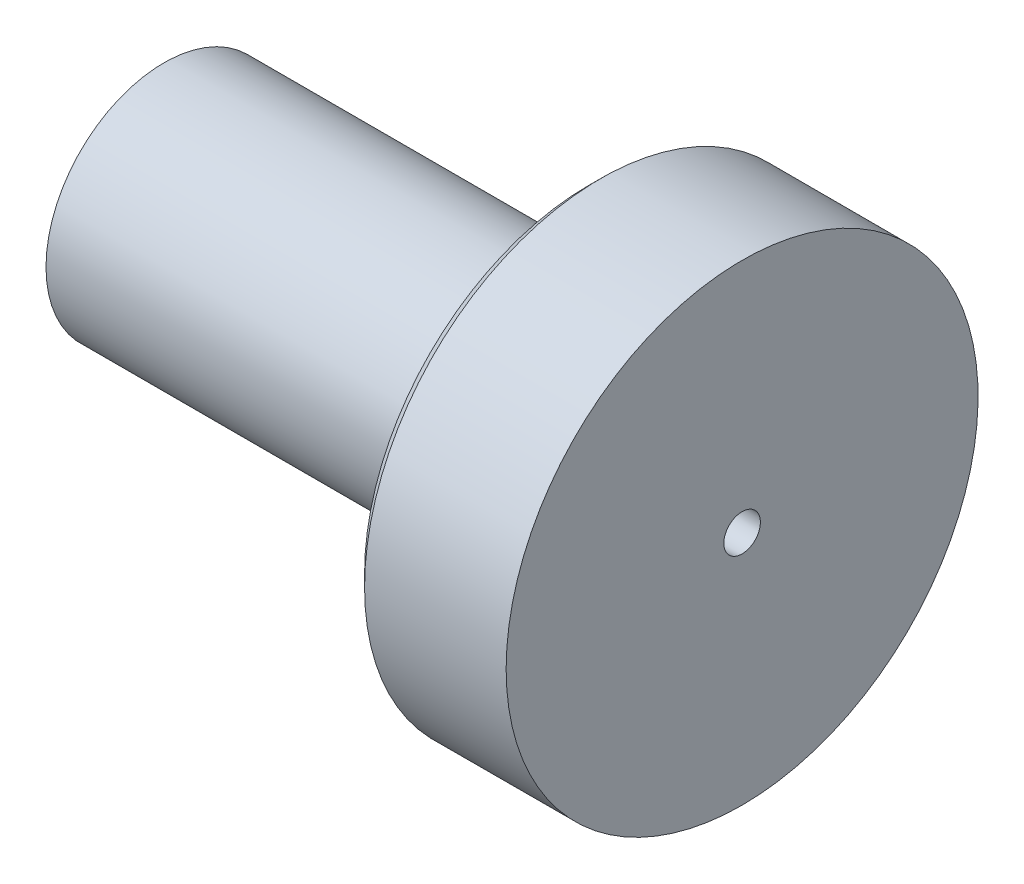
ISO-10303-21;
HEADER;
FILE_DESCRIPTION(('STEP AP214'),'2;1');
FILE_NAME('part.step','',(''),(''),'','','');
FILE_SCHEMA(('AUTOMOTIVE_DESIGN { 1 0 10303 214 1 1 1 1 }'));
ENDSEC;
DATA;
#1=APPLICATION_CONTEXT('core data for automotive mechanical design processes');
#2=APPLICATION_PROTOCOL_DEFINITION('international standard','automotive_design',2000,#1);
#3=PRODUCT_CONTEXT('',#1,'mechanical');
#4=PRODUCT('Part','Part','',(#3));
#5=PRODUCT_RELATED_PRODUCT_CATEGORY('part','',(#4));
#6=PRODUCT_DEFINITION_FORMATION('','',#4);
#7=PRODUCT_DEFINITION_CONTEXT('part definition',#1,'design');
#8=PRODUCT_DEFINITION('design','',#6,#7);
#9=PRODUCT_DEFINITION_SHAPE('','',#8);
#10=(LENGTH_UNIT() NAMED_UNIT(*) SI_UNIT(.MILLI.,.METRE.));
#11=(NAMED_UNIT(*) PLANE_ANGLE_UNIT() SI_UNIT($,.RADIAN.));
#12=(NAMED_UNIT(*) SI_UNIT($,.STERADIAN.) SOLID_ANGLE_UNIT());
#13=UNCERTAINTY_MEASURE_WITH_UNIT(LENGTH_MEASURE(1.E-05),#10,'distance_accuracy_value','');
#14=(GEOMETRIC_REPRESENTATION_CONTEXT(3) GLOBAL_UNCERTAINTY_ASSIGNED_CONTEXT((#13)) GLOBAL_UNIT_ASSIGNED_CONTEXT((#10,
#11,#12)) REPRESENTATION_CONTEXT('',''));
#15=CARTESIAN_POINT('',(0.,0.,0.));
#16=DIRECTION('',(0.,0.,1.));
#17=DIRECTION('',(1.,0.,0.));
#18=AXIS2_PLACEMENT_3D('',#15,#16,#17);
#19=CARTESIAN_POINT('',(0.,0.,0.));
#20=DIRECTION('',(-1.,0.,0.));
#21=DIRECTION('',(0.,0.,1.));
#22=AXIS2_PLACEMENT_3D('',#19,#20,#21);
#23=CYLINDRICAL_SURFACE('',#22,10.);
#24=CARTESIAN_POINT('',(36.,0.,0.));
#25=DIRECTION('',(-1.,0.,0.));
#26=DIRECTION('',(0.,0.,1.));
#27=AXIS2_PLACEMENT_3D('',#24,#25,#26);
#28=CIRCLE('',#27,10.);
#29=CARTESIAN_POINT('',(36.,0.,10.));
#30=VERTEX_POINT('',#29);
#31=EDGE_CURVE('E10',#30,#30,#28,.T.);
#32=ORIENTED_EDGE('',*,*,#31,.T.);
#33=EDGE_LOOP('',(#32));
#34=FACE_BOUND('',#33,.T.);
#35=CARTESIAN_POINT('',(4.,0.,0.));
#36=DIRECTION('',(-1.,0.,0.));
#37=DIRECTION('',(0.,-1.,0.));
#38=AXIS2_PLACEMENT_3D('',#35,#36,#37);
#39=CIRCLE('',#38,10.);
#40=CARTESIAN_POINT('',(4.,-10.,0.));
#41=VERTEX_POINT('',#40);
#42=EDGE_CURVE('E44',#41,#41,#39,.F.);
#43=ORIENTED_EDGE('',*,*,#42,.T.);
#44=EDGE_LOOP('',(#43));
#45=FACE_BOUND('',#44,.T.);
#46=ADVANCED_FACE('F26',(#34,#45),#23,.T.);
#47=CARTESIAN_POINT('',(55.,0.,0.));
#48=DIRECTION('',(-1.,0.,0.));
#49=DIRECTION('',(0.,0.,1.));
#50=AXIS2_PLACEMENT_3D('',#47,#48,#49);
#51=CONICAL_SURFACE('',#50,1.5,0.0250454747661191);
#52=CARTESIAN_POINT('',(53.,0.,0.));
#53=DIRECTION('',(-1.,0.,0.));
#54=DIRECTION('',(0.,-1.,0.));
#55=AXIS2_PLACEMENT_3D('',#52,#53,#54);
#56=CIRCLE('',#55,1.55010142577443);
#57=CARTESIAN_POINT('',(53.,-1.55010142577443,0.));
#58=VERTEX_POINT('',#57);
#59=EDGE_CURVE('E41',#58,#58,#56,.T.);
#60=ORIENTED_EDGE('',*,*,#59,.F.);
#61=EDGE_LOOP('',(#60));
#62=FACE_BOUND('',#61,.T.);
#63=CARTESIAN_POINT('',(4.,0.,0.));
#64=DIRECTION('',(-1.,0.,0.));
#65=DIRECTION('',(0.,-1.,0.));
#66=AXIS2_PLACEMENT_3D('',#63,#64,#65);
#67=CIRCLE('',#66,2.77758635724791);
#68=CARTESIAN_POINT('',(4.,-2.77758635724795,0.));
#69=VERTEX_POINT('',#68);
#70=EDGE_CURVE('E29',#69,#69,#67,.T.);
#71=ORIENTED_EDGE('',*,*,#70,.T.);
#72=EDGE_LOOP('',(#71));
#73=FACE_BOUND('',#72,.T.);
#74=ADVANCED_FACE('F78',(#62,#73),#51,.F.);
#75=CARTESIAN_POINT('',(36.,0.,0.));
#76=DIRECTION('',(-1.,0.,0.));
#77=DIRECTION('',(0.,0.,1.));
#78=AXIS2_PLACEMENT_3D('',#75,#76,#77);
#79=TOROIDAL_SURFACE('',#78,14.,4.);
#80=CARTESIAN_POINT('',(40.,0.,0.));
#81=DIRECTION('',(-1.,0.,0.));
#82=DIRECTION('',(0.,0.,1.));
#83=AXIS2_PLACEMENT_3D('',#80,#81,#82);
#84=CIRCLE('',#83,14.);
#85=CARTESIAN_POINT('',(40.,0.,14.));
#86=VERTEX_POINT('',#85);
#87=EDGE_CURVE('E33',#86,#86,#84,.T.);
#88=ORIENTED_EDGE('',*,*,#87,.T.);
#89=EDGE_LOOP('',(#88));
#90=FACE_BOUND('',#89,.T.);
#91=ORIENTED_EDGE('',*,*,#31,.F.);
#92=EDGE_LOOP('',(#91));
#93=FACE_BOUND('',#92,.T.);
#94=ADVANCED_FACE('F75',(#90,#93),#79,.F.);
#95=CARTESIAN_POINT('',(40.,14.,0.));
#96=DIRECTION('',(-1.,0.,0.));
#97=DIRECTION('',(0.,0.,1.));
#98=AXIS2_PLACEMENT_3D('',#95,#96,#97);
#99=PLANE('',#98);
#100=CARTESIAN_POINT('',(40.,0.,0.));
#101=DIRECTION('',(-1.,0.,0.));
#102=DIRECTION('',(0.,0.,1.));
#103=AXIS2_PLACEMENT_3D('',#100,#101,#102);
#104=CIRCLE('',#103,19.);
#105=CARTESIAN_POINT('',(40.,0.,19.));
#106=VERTEX_POINT('',#105);
#107=EDGE_CURVE('E38',#106,#106,#104,.T.);
#108=ORIENTED_EDGE('',*,*,#107,.T.);
#109=EDGE_LOOP('',(#108));
#110=FACE_BOUND('',#109,.T.);
#111=ORIENTED_EDGE('',*,*,#87,.F.);
#112=EDGE_LOOP('',(#111));
#113=FACE_BOUND('',#112,.T.);
#114=ADVANCED_FACE('F60',(#110,#113),#99,.T.);
#115=CARTESIAN_POINT('',(40.,0.,0.));
#116=DIRECTION('',(1.,0.,0.));
#117=DIRECTION('',(0.,0.,-1.));
#118=AXIS2_PLACEMENT_3D('',#115,#116,#117);
#119=CONICAL_SURFACE('',#118,19.,0.785398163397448);
#120=CARTESIAN_POINT('',(41.,0.,0.));
#121=DIRECTION('',(-1.,0.,0.));
#122=DIRECTION('',(0.,0.,1.));
#123=AXIS2_PLACEMENT_3D('',#120,#121,#122);
#124=CIRCLE('',#123,20.);
#125=CARTESIAN_POINT('',(41.,0.,20.));
#126=VERTEX_POINT('',#125);
#127=EDGE_CURVE('E48',#126,#126,#124,.T.);
#128=ORIENTED_EDGE('',*,*,#127,.T.);
#129=EDGE_LOOP('',(#128));
#130=FACE_BOUND('',#129,.T.);
#131=ORIENTED_EDGE('',*,*,#107,.F.);
#132=EDGE_LOOP('',(#131));
#133=FACE_BOUND('',#132,.T.);
#134=ADVANCED_FACE('F63',(#130,#133),#119,.T.);
#135=CARTESIAN_POINT('',(0.,0.,0.));
#136=DIRECTION('',(-1.,0.,0.));
#137=DIRECTION('',(0.,0.,1.));
#138=AXIS2_PLACEMENT_3D('',#135,#136,#137);
#139=CYLINDRICAL_SURFACE('',#138,20.);
#140=CARTESIAN_POINT('',(53.,0.,0.));
#141=DIRECTION('',(-1.,0.,0.));
#142=DIRECTION('',(0.,-1.,0.));
#143=AXIS2_PLACEMENT_3D('',#140,#141,#142);
#144=CIRCLE('',#143,20.);
#145=CARTESIAN_POINT('',(53.,-20.,0.));
#146=VERTEX_POINT('',#145);
#147=EDGE_CURVE('E43',#146,#146,#144,.F.);
#148=ORIENTED_EDGE('',*,*,#147,.F.);
#149=EDGE_LOOP('',(#148));
#150=FACE_BOUND('',#149,.T.);
#151=ORIENTED_EDGE('',*,*,#127,.F.);
#152=EDGE_LOOP('',(#151));
#153=FACE_BOUND('',#152,.T.);
#154=ADVANCED_FACE('F65',(#150,#153),#139,.T.);
#155=CARTESIAN_POINT('',(53.,20.,-20.));
#156=DIRECTION('',(-1.,0.,0.));
#157=DIRECTION('',(0.,-1.,0.));
#158=AXIS2_PLACEMENT_3D('',#155,#156,#157);
#159=PLANE('',#158);
#160=ORIENTED_EDGE('',*,*,#147,.T.);
#161=EDGE_LOOP('',(#160));
#162=FACE_BOUND('',#161,.T.);
#163=ORIENTED_EDGE('',*,*,#59,.T.);
#164=EDGE_LOOP('',(#163));
#165=FACE_BOUND('',#164,.T.);
#166=ADVANCED_FACE('F72',(#162,#165),#159,.F.);
#167=CARTESIAN_POINT('',(4.,10.,-20.));
#168=DIRECTION('',(-1.,0.,0.));
#169=DIRECTION('',(0.,-1.,0.));
#170=AXIS2_PLACEMENT_3D('',#167,#168,#169);
#171=PLANE('',#170);
#172=ORIENTED_EDGE('',*,*,#70,.F.);
#173=EDGE_LOOP('',(#172));
#174=FACE_BOUND('',#173,.T.);
#175=ORIENTED_EDGE('',*,*,#42,.F.);
#176=EDGE_LOOP('',(#175));
#177=FACE_BOUND('',#176,.T.);
#178=ADVANCED_FACE('F92',(#174,#177),#171,.T.);
#179=CLOSED_SHELL('',(#46,#74,#94,#114,#134,#154,#166,#178));
#180=MANIFOLD_SOLID_BREP('B2',#179);
#181=ADVANCED_BREP_SHAPE_REPRESENTATION('',(#18,#180),#14);
#182=SHAPE_DEFINITION_REPRESENTATION(#9,#181);
ENDSEC;
END-ISO-10303-21;
